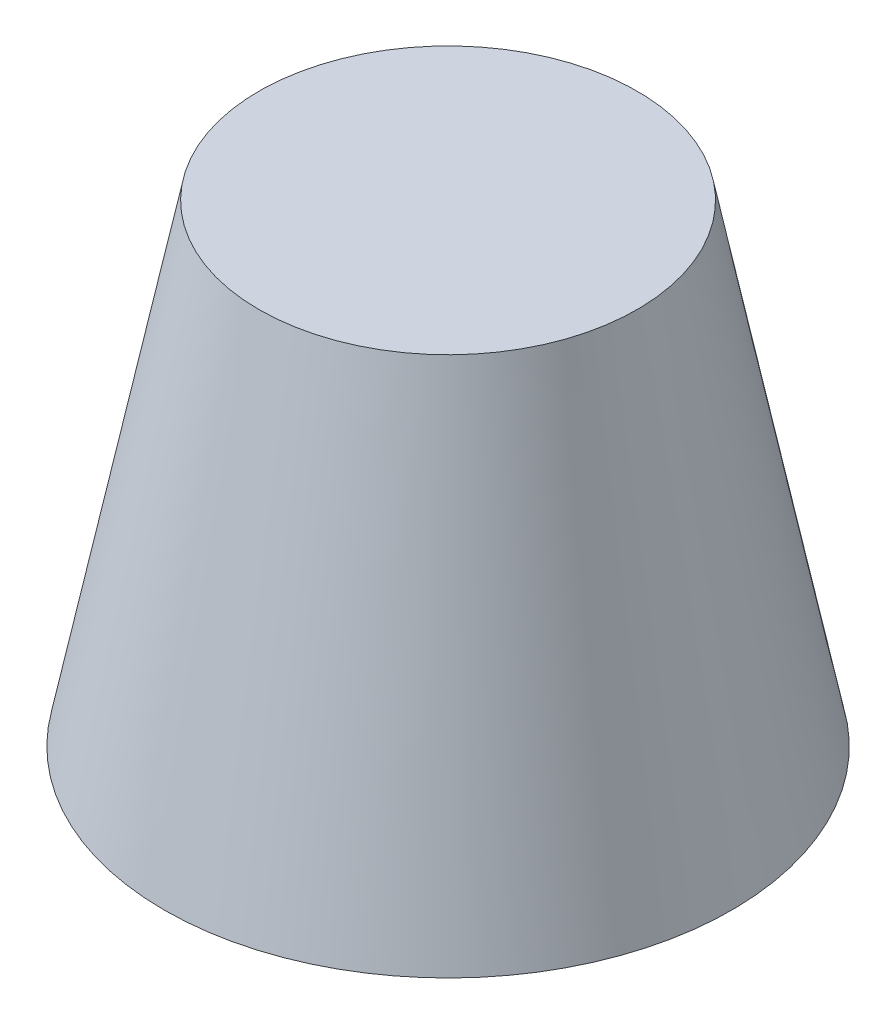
from build123d import *


with BuildPart() as part:
    # Esquisse1 → Revolve 196 (revolve)
    with BuildSketch(Plane.XY, mode=Mode.PRIVATE) as revolve_196_sk:
        Polygon((0, 0), (6, 0), (4, 10), (0, 10), align=None)
    revolve(revolve_196_sk.sketch.rotate(Axis((0, 24, 0), (0, -1, 0)), 90), axis=Axis((0, 24, 0), (0, -1, 0)))


solid = part.part
